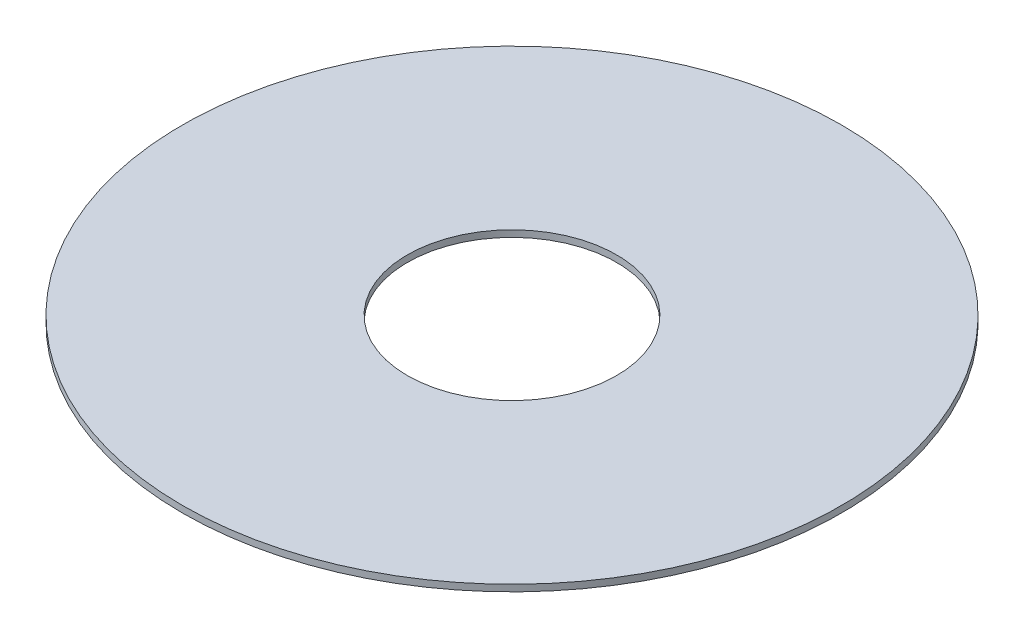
from build123d import *

# Parameters (mm, degrees)
IZIM1_R                     = 100
IZIM1_R_2                   = 31.75
Y_KSEKLIK_EKSTR_ZYON1_DEPTH = 2


with BuildPart() as part:
    # izim1 → Y_kseklik-Ekstr_zyon1 (new body)
    with BuildSketch(Plane(origin=(0, 0, 0), x_dir=(1, 0, 0), z_dir=(0, 1, 0))):
        with Locations(Location((0, 0, 0), (0, 0, 270))):
            Circle(IZIM1_R)
        with Locations(Location((0, 0, 0), (0, 0, 270))):
            Circle(IZIM1_R_2, mode=Mode.SUBTRACT)
    extrude(amount=Y_KSEKLIK_EKSTR_ZYON1_DEPTH)


solid = part.part
